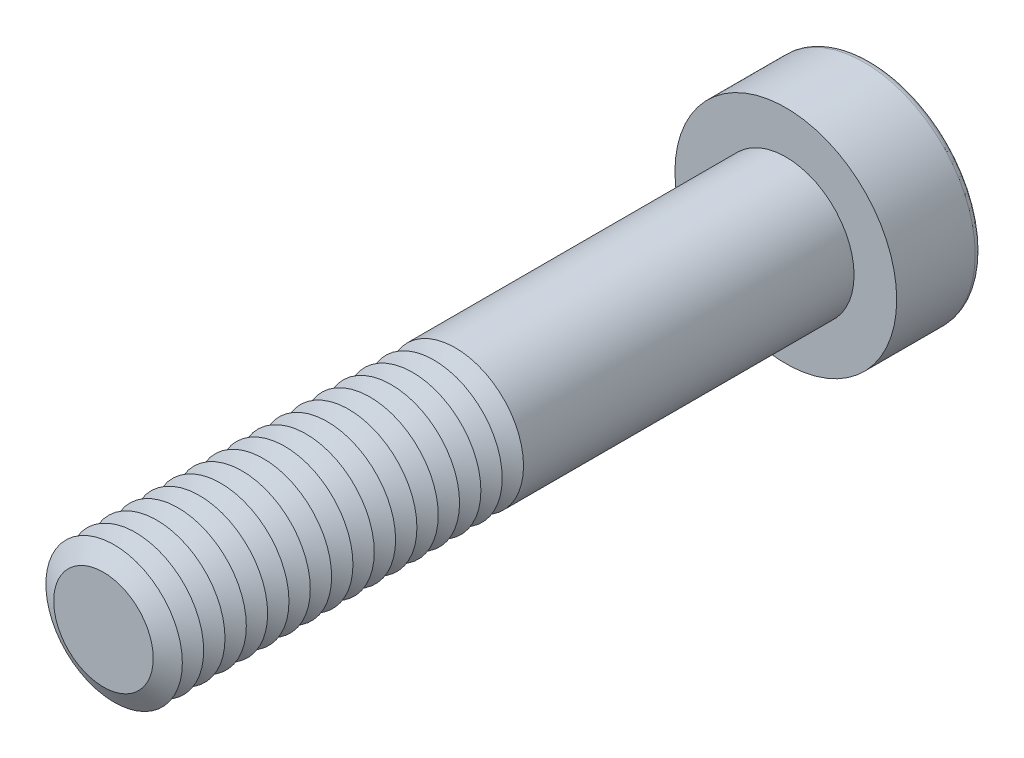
from build123d import *

# Parameters (mm, degrees)
SKETCH1_R           = 4
BOSS_EXTRUDE1_DEPTH = 40
SKETCH2_R           = 6.5
BOSS_EXTRUDE2_DEPTH = 5
CUT_EXTRUDE1_DEPTH  = 3.75
FILLET1_R           = 0.4
LPATTERN1_COUNT     = 17
LPATTERN1_PITCH     = 1.25


with BuildPart() as part:
    # Sketch1 → Boss-Extrude1 (new body)
    with BuildSketch(Plane.XY):
        Circle(SKETCH1_R)
    extrude(amount=BOSS_EXTRUDE1_DEPTH)

    # Sketch2 → Boss-Extrude2 (add)
    with BuildSketch(Plane(origin=(0, 0, 0), x_dir=(-1, 0, 0), z_dir=(0, 0, -1))):
        Circle(SKETCH2_R)
    extrude(amount=BOSS_EXTRUDE2_DEPTH)

    # Sketch3 → Cut-Extrude1 (cut)
    with BuildSketch(Plane(origin=(0, 0, -5), x_dir=(-1, 0, 0), z_dir=(0, 0, -1))):
        Polygon((-1.443375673, 2.5), (-2.886751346, 0), (-1.443375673, -2.5), (1.443375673, -2.5), (2.886751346, 0), (1.443375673, 2.5), align=None)
    extrude(amount=-CUT_EXTRUDE1_DEPTH, mode=Mode.SUBTRACT)

    # Fillet1
    fillet1_edges = [part.edges().sort_by_distance(p)[0] for p in [
        (6.5, 0, -5),
    ]]
    fillet(fillet1_edges, radius=FILLET1_R)

    # Cut-Extrude2 cone 1 section (on through the dimple's axis) → Cut-Extrude2 (revolve, cut)
    with BuildSketch(Plane(origin=(0, 0, -1.25), x_dir=(0, 1, 0), z_dir=(1, 0, 0))):
        Polygon((0, 0), (2.5, 0), (0, 1.443375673), align=None)
    revolve(axis=Axis((0, 0, -1.25), (0, 0, 1)), mode=Mode.SUBTRACT)

    # Cut-Extrude3 cone 1 section (on through the dimple's axis) → Cut-Extrude3 (revolve, cut)
    with BuildSketch(Plane(origin=(0, 0, -5), x_dir=(0, 1, 0), z_dir=(1, 0, 0))):
        Polygon((0, 0), (2.886751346, 0), (0, 0.773502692), align=None)
    revolve(axis=Axis((0, 0, -5), (0, 0, 1)), mode=Mode.SUBTRACT)

    # Sketch7 → Cut-Revolve1 (revolve, cut)
    with BuildSketch(Plane(origin=(0, 0, 0), x_dir=(0, 0, -1), z_dir=(1, 0, 0)), mode=Mode.PRIVATE) as cut_revolve1_sk:
        Polygon((-40, 2.917468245), (-39.375, 4), (-40.625, 4), align=None)
    cut_revolve1 = revolve(cut_revolve1_sk.sketch.rotate(Axis((0, 0, 40), (0, 0, -1)), 90), axis=Axis((0, 0, 40), (0, 0, -1)), mode=Mode.SUBTRACT)

    # LPattern1: Cut-Revolve1 ×17
    with Locations(*[(0, 0, -i * LPATTERN1_PITCH) for i in range(1, LPATTERN1_COUNT)]):
        add(cut_revolve1, mode=Mode.SUBTRACT)


solid = part.part
